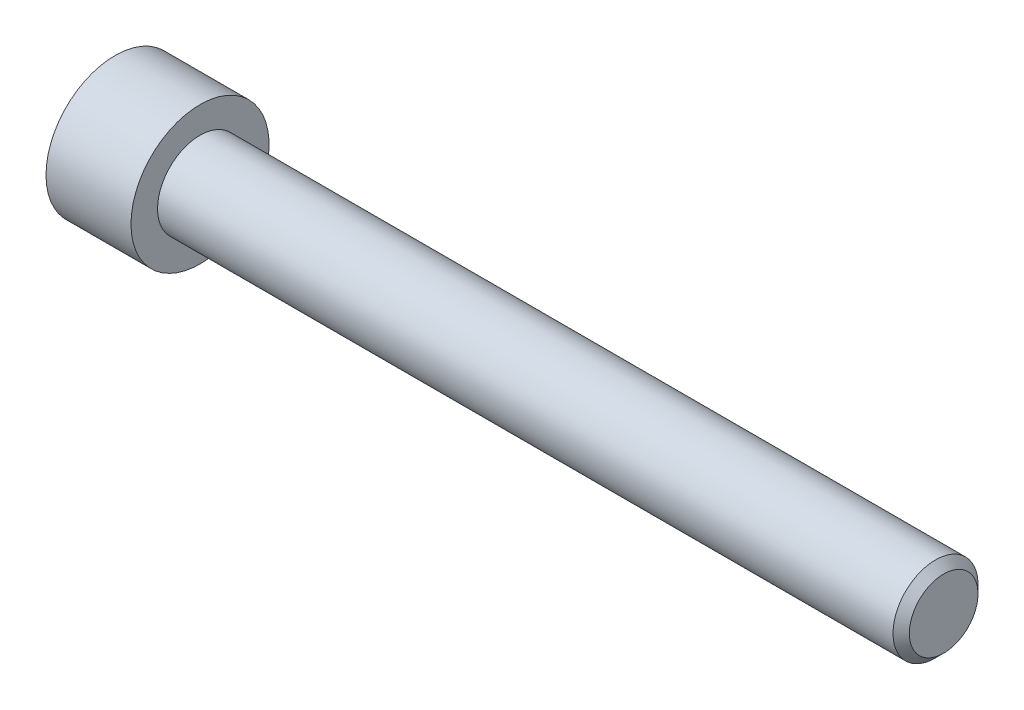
from build123d import *

# Parameters (mm, degrees)
ENL_V_MAT_EXTRU_1_DEPTH = 4


with BuildPart() as part:
    # Esquisse1 → R_volution1 (revolve)
    with BuildSketch(Plane.XY, mode=Mode.PRIVATE) as r_volution1_sk:
        Polygon((-8, 0), (-8, 6.5), (0, 6.5), (0, 4), (69.233, 4), (70, 3.233), (70, 0), align=None)
    revolve(r_volution1_sk.sketch.rotate(Axis((70, 0, 0), (-1, 0, 0)), 270), axis=Axis((70, 0, 0), (-1, 0, 0)))

    # Esquisse2 → Enl_v. mat.-Extru.1 (cut)
    with BuildSketch(Plane(origin=(-8, 0, 0), x_dir=(0, 0, -1), z_dir=(1, 0, 0))):
        Polygon((-3, 1.732050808), (-3, -1.732050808), (0, -3.464101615), (3, -1.732050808), (3, 1.732050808), (0, 3.464101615), align=None)
    extrude(amount=ENL_V_MAT_EXTRU_1_DEPTH, mode=Mode.SUBTRACT)

    # Esquisse3 → Enl_vement de mati_re-R_volution1 (revolve, cut)
    with BuildSketch(Plane.XY, mode=Mode.PRIVATE) as enl_vement_de_mati_re_r_volution1_sk:
        Polygon((-4, 0), (-4, 2.99), (-2.273722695, 0), align=None)
    revolve(enl_vement_de_mati_re_r_volution1_sk.sketch.rotate(Axis((-2.273722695, 0, 0), (-1, 0, 0)), 270), axis=Axis((-2.273722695, 0, 0), (-1, 0, 0)), mode=Mode.SUBTRACT)


solid = part.part
